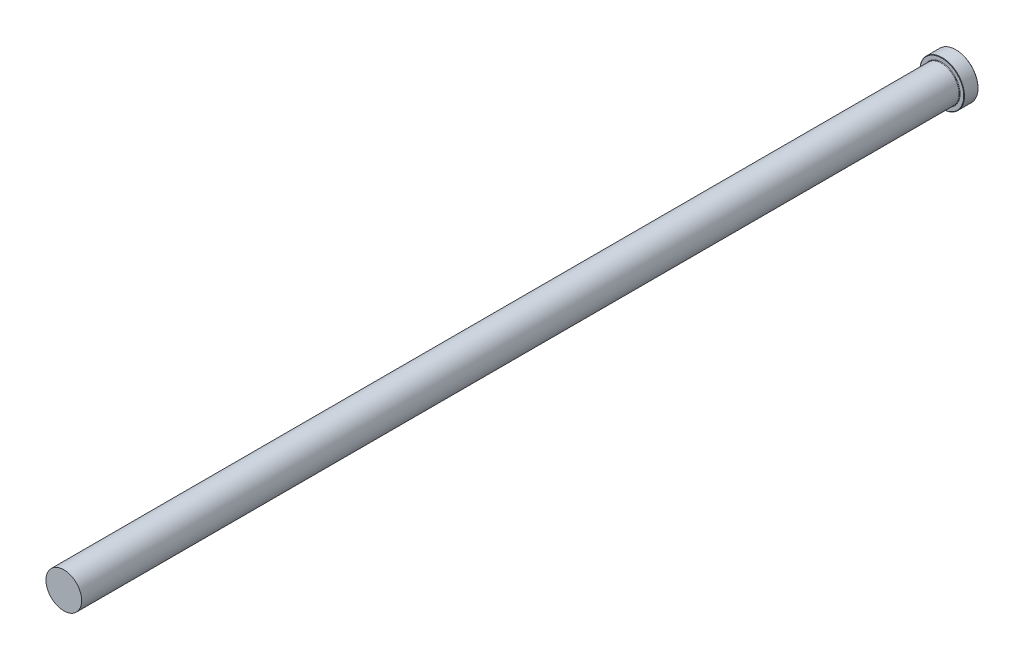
from build123d import *

# Parameters (mm, degrees)
CHAMFER1_SIZE = 0.2


with BuildPart() as part:
    # Sketch1 → Revolve1 (revolve)
    with BuildSketch(Plane(origin=(0, 0, 0), x_dir=(0, 0, -1), z_dir=(1, 0, 0)), mode=Mode.PRIVATE) as revolve1_sk:
        with BuildLine():
            Line((0, 0), (0, 12.5))
            Line((0, 12.5), (-8, 12.5))
            Line((-8, 12.5), (-8, 10.3))
            ThreePointArc((-8, 10.3), (-8.087867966, 10.087867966), (-8.3, 10))
            Line((-8.3, 10), (-500, 10))
            Line((-500, 10), (-500, 0))
            Line((-500, 0), (0, 0))
        make_face()
    revolve(revolve1_sk.sketch.rotate(Axis((0, 0, 109.05062828), (0, 0, -1)), 90), axis=Axis((0, 0, 109.05062828), (0, 0, -1)))

    # Chamfer1
    chamfer1_edges = [part.edges().sort_by_distance(p)[0] for p in [
        (-12.5, 0, 0),
        (-12.5, 0, 8),
    ]]
    chamfer(chamfer1_edges, length=CHAMFER1_SIZE)


solid = part.part
